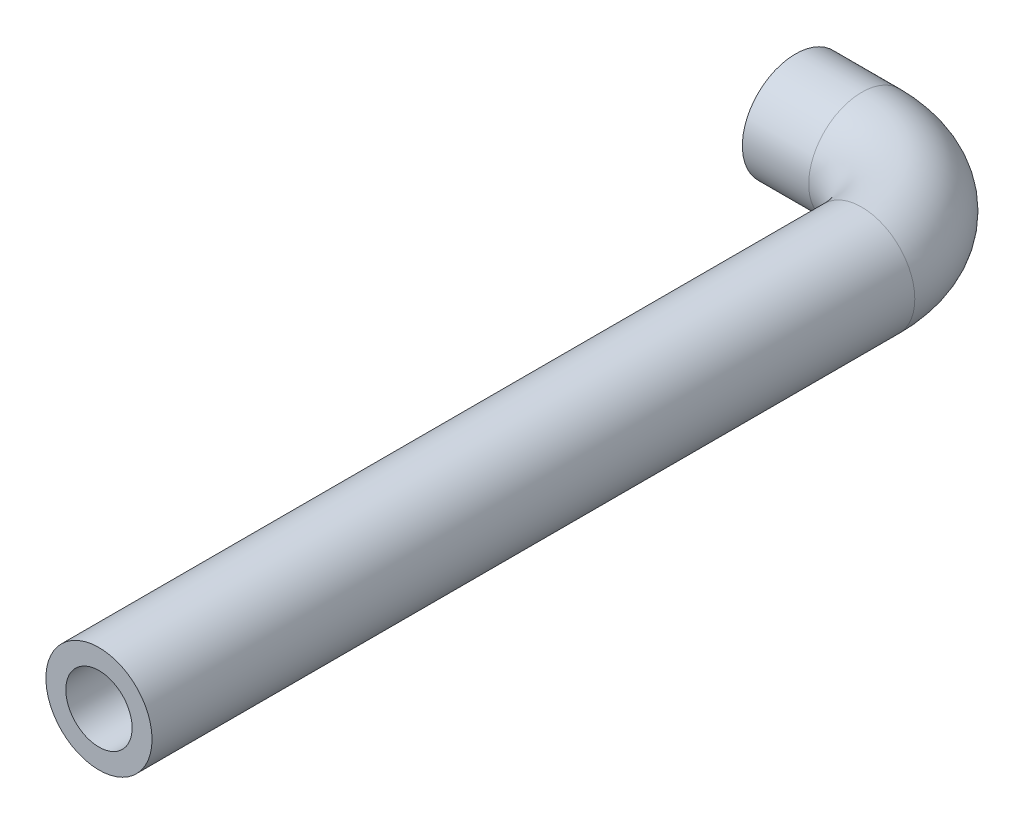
ISO-10303-21;
HEADER;
FILE_DESCRIPTION(('STEP AP214'),'2;1');
FILE_NAME('part.step','',(''),(''),'','','');
FILE_SCHEMA(('AUTOMOTIVE_DESIGN { 1 0 10303 214 1 1 1 1 }'));
ENDSEC;
DATA;
#1=APPLICATION_CONTEXT('core data for automotive mechanical design processes');
#2=APPLICATION_PROTOCOL_DEFINITION('international standard','automotive_design',2000,#1);
#3=PRODUCT_CONTEXT('',#1,'mechanical');
#4=PRODUCT('Part','Part','',(#3));
#5=PRODUCT_RELATED_PRODUCT_CATEGORY('part','',(#4));
#6=PRODUCT_DEFINITION_FORMATION('','',#4);
#7=PRODUCT_DEFINITION_CONTEXT('part definition',#1,'design');
#8=PRODUCT_DEFINITION('design','',#6,#7);
#9=PRODUCT_DEFINITION_SHAPE('','',#8);
#10=(LENGTH_UNIT() NAMED_UNIT(*) SI_UNIT(.MILLI.,.METRE.));
#11=(NAMED_UNIT(*) PLANE_ANGLE_UNIT() SI_UNIT($,.RADIAN.));
#12=(NAMED_UNIT(*) SI_UNIT($,.STERADIAN.) SOLID_ANGLE_UNIT());
#13=UNCERTAINTY_MEASURE_WITH_UNIT(LENGTH_MEASURE(1.E-05),#10,'distance_accuracy_value','');
#14=(GEOMETRIC_REPRESENTATION_CONTEXT(3) GLOBAL_UNCERTAINTY_ASSIGNED_CONTEXT((#13)) GLOBAL_UNIT_ASSIGNED_CONTEXT((#10,
#11,#12)) REPRESENTATION_CONTEXT('',''));
#15=CARTESIAN_POINT('',(0.,0.,0.));
#16=DIRECTION('',(0.,0.,1.));
#17=DIRECTION('',(1.,0.,0.));
#18=AXIS2_PLACEMENT_3D('',#15,#16,#17);
#19=CARTESIAN_POINT('',(0.,0.,0.));
#20=DIRECTION('',(1.,0.,0.));
#21=DIRECTION('',(0.,0.,-1.));
#22=AXIS2_PLACEMENT_3D('',#19,#20,#21);
#23=CYLINDRICAL_SURFACE('',#22,8.);
#24=CARTESIAN_POINT('',(10.,0.,0.));
#25=DIRECTION('',(1.,0.,0.));
#26=DIRECTION('',(0.,0.,-1.));
#27=AXIS2_PLACEMENT_3D('',#24,#25,#26);
#28=CIRCLE('',#27,8.);
#29=CARTESIAN_POINT('',(10.,0.,-8.));
#30=VERTEX_POINT('',#29);
#31=EDGE_CURVE('E79',#30,#30,#28,.T.);
#32=ORIENTED_EDGE('',*,*,#31,.F.);
#33=EDGE_LOOP('',(#32));
#34=FACE_BOUND('',#33,.T.);
#35=CARTESIAN_POINT('',(0.,0.,0.));
#36=DIRECTION('',(1.,0.,0.));
#37=DIRECTION('',(0.,0.,-1.));
#38=AXIS2_PLACEMENT_3D('',#35,#36,#37);
#39=CIRCLE('',#38,8.);
#40=CARTESIAN_POINT('',(0.,0.,-8.));
#41=VERTEX_POINT('',#40);
#42=EDGE_CURVE('E48',#41,#41,#39,.T.);
#43=ORIENTED_EDGE('',*,*,#42,.T.);
#44=EDGE_LOOP('',(#43));
#45=FACE_BOUND('',#44,.T.);
#46=ADVANCED_FACE('F33',(#34,#45),#23,.T.);
#47=CARTESIAN_POINT('',(10.,0.,15.));
#48=DIRECTION('',(0.,-1.,0.));
#49=DIRECTION('',(0.,0.,-1.));
#50=AXIS2_PLACEMENT_3D('',#47,#48,#49);
#51=TOROIDAL_SURFACE('',#50,15.,8.);
#52=CARTESIAN_POINT('',(25.,0.,15.));
#53=DIRECTION('',(0.,0.,1.));
#54=DIRECTION('',(1.,0.,0.));
#55=AXIS2_PLACEMENT_3D('',#52,#53,#54);
#56=CIRCLE('',#55,8.);
#57=CARTESIAN_POINT('',(33.,0.,15.));
#58=VERTEX_POINT('',#57);
#59=EDGE_CURVE('E37',#58,#58,#56,.T.);
#60=CARTESIAN_POINT('',(10.,0.,15.));
#61=DIRECTION('',(0.,-1.,0.));
#62=DIRECTION('',(0.,0.,-1.));
#63=AXIS2_PLACEMENT_3D('',#60,#61,#62);
#64=CIRCLE('',#63,23.);
#65=EDGE_CURVE('',#30,#58,#64,.T.);
#66=ORIENTED_EDGE('',*,*,#31,.T.);
#67=ORIENTED_EDGE('',*,*,#59,.F.);
#68=ORIENTED_EDGE('',*,*,#65,.T.);
#69=ORIENTED_EDGE('',*,*,#65,.F.);
#70=EDGE_LOOP('',(#66,#68,#67,#69));
#71=FACE_BOUND('',#70,.T.);
#72=ADVANCED_FACE('F87',(#71),#51,.T.);
#73=CARTESIAN_POINT('',(25.,0.,15.));
#74=DIRECTION('',(0.,0.,1.));
#75=DIRECTION('',(1.,0.,0.));
#76=AXIS2_PLACEMENT_3D('',#73,#74,#75);
#77=CYLINDRICAL_SURFACE('',#76,8.);
#78=CARTESIAN_POINT('',(25.,0.,130.));
#79=DIRECTION('',(0.,0.,1.));
#80=DIRECTION('',(1.,0.,0.));
#81=AXIS2_PLACEMENT_3D('',#78,#79,#80);
#82=CIRCLE('',#81,8.);
#83=CARTESIAN_POINT('',(33.,0.,130.));
#84=VERTEX_POINT('',#83);
#85=EDGE_CURVE('E53',#84,#84,#82,.T.);
#86=ORIENTED_EDGE('',*,*,#85,.F.);
#87=EDGE_LOOP('',(#86));
#88=FACE_BOUND('',#87,.T.);
#89=ORIENTED_EDGE('',*,*,#59,.T.);
#90=EDGE_LOOP('',(#89));
#91=FACE_BOUND('',#90,.T.);
#92=ADVANCED_FACE('F35',(#88,#91),#77,.T.);
#93=CARTESIAN_POINT('',(0.,0.,0.));
#94=DIRECTION('',(1.,0.,0.));
#95=DIRECTION('',(0.,0.,-1.));
#96=AXIS2_PLACEMENT_3D('',#93,#94,#95);
#97=PLANE('',#96);
#98=CARTESIAN_POINT('',(0.,0.,0.));
#99=DIRECTION('',(1.,0.,0.));
#100=DIRECTION('',(0.,0.,-1.));
#101=AXIS2_PLACEMENT_3D('',#98,#99,#100);
#102=CIRCLE('',#101,5.);
#103=CARTESIAN_POINT('',(0.,0.,-5.));
#104=VERTEX_POINT('',#103);
#105=EDGE_CURVE('E74',#104,#104,#102,.F.);
#106=ORIENTED_EDGE('',*,*,#105,.F.);
#107=EDGE_LOOP('',(#106));
#108=FACE_BOUND('',#107,.T.);
#109=ORIENTED_EDGE('',*,*,#42,.F.);
#110=EDGE_LOOP('',(#109));
#111=FACE_BOUND('',#110,.T.);
#112=ADVANCED_FACE('F93',(#108,#111),#97,.F.);
#113=CARTESIAN_POINT('',(25.,0.,130.));
#114=DIRECTION('',(0.,0.,1.));
#115=DIRECTION('',(1.,0.,0.));
#116=AXIS2_PLACEMENT_3D('',#113,#114,#115);
#117=PLANE('',#116);
#118=CARTESIAN_POINT('',(25.,0.,130.));
#119=DIRECTION('',(0.,0.,1.));
#120=DIRECTION('',(1.,0.,0.));
#121=AXIS2_PLACEMENT_3D('',#118,#119,#120);
#122=CIRCLE('',#121,5.);
#123=CARTESIAN_POINT('',(30.,0.,130.));
#124=VERTEX_POINT('',#123);
#125=EDGE_CURVE('E11',#124,#124,#122,.F.);
#126=ORIENTED_EDGE('',*,*,#125,.T.);
#127=EDGE_LOOP('',(#126));
#128=FACE_BOUND('',#127,.T.);
#129=ORIENTED_EDGE('',*,*,#85,.T.);
#130=EDGE_LOOP('',(#129));
#131=FACE_BOUND('',#130,.T.);
#132=ADVANCED_FACE('F60',(#128,#131),#117,.T.);
#133=CARTESIAN_POINT('',(0.,0.,0.));
#134=DIRECTION('',(1.,0.,0.));
#135=DIRECTION('',(0.,0.,-1.));
#136=AXIS2_PLACEMENT_3D('',#133,#134,#135);
#137=CYLINDRICAL_SURFACE('',#136,5.);
#138=CARTESIAN_POINT('',(10.,0.,0.));
#139=DIRECTION('',(1.,0.,0.));
#140=DIRECTION('',(0.,0.,-1.));
#141=AXIS2_PLACEMENT_3D('',#138,#139,#140);
#142=CIRCLE('',#141,5.);
#143=CARTESIAN_POINT('',(10.,0.,-5.));
#144=VERTEX_POINT('',#143);
#145=EDGE_CURVE('E71',#144,#144,#142,.F.);
#146=ORIENTED_EDGE('',*,*,#145,.F.);
#147=EDGE_LOOP('',(#146));
#148=FACE_BOUND('',#147,.T.);
#149=ORIENTED_EDGE('',*,*,#105,.T.);
#150=EDGE_LOOP('',(#149));
#151=FACE_BOUND('',#150,.T.);
#152=ADVANCED_FACE('F101',(#148,#151),#137,.F.);
#153=CARTESIAN_POINT('',(10.,0.,15.));
#154=DIRECTION('',(0.,-1.,0.));
#155=DIRECTION('',(0.,0.,-1.));
#156=AXIS2_PLACEMENT_3D('',#153,#154,#155);
#157=TOROIDAL_SURFACE('',#156,15.,5.);
#158=CARTESIAN_POINT('',(25.,0.,15.));
#159=DIRECTION('',(0.,0.,1.));
#160=DIRECTION('',(1.,0.,0.));
#161=AXIS2_PLACEMENT_3D('',#158,#159,#160);
#162=CIRCLE('',#161,5.);
#163=CARTESIAN_POINT('',(30.,0.,15.));
#164=VERTEX_POINT('',#163);
#165=EDGE_CURVE('E42',#164,#164,#162,.F.);
#166=CARTESIAN_POINT('',(10.,0.,15.));
#167=DIRECTION('',(0.,-1.,0.));
#168=DIRECTION('',(0.,0.,-1.));
#169=AXIS2_PLACEMENT_3D('',#166,#167,#168);
#170=CIRCLE('',#169,20.);
#171=EDGE_CURVE('',#144,#164,#170,.T.);
#172=ORIENTED_EDGE('',*,*,#145,.T.);
#173=ORIENTED_EDGE('',*,*,#165,.F.);
#174=ORIENTED_EDGE('',*,*,#171,.T.);
#175=ORIENTED_EDGE('',*,*,#171,.F.);
#176=EDGE_LOOP('',(#172,#174,#173,#175));
#177=FACE_BOUND('',#176,.T.);
#178=ADVANCED_FACE('F66',(#177),#157,.F.);
#179=CARTESIAN_POINT('',(25.,0.,15.));
#180=DIRECTION('',(0.,0.,1.));
#181=DIRECTION('',(1.,0.,0.));
#182=AXIS2_PLACEMENT_3D('',#179,#180,#181);
#183=CYLINDRICAL_SURFACE('',#182,5.);
#184=ORIENTED_EDGE('',*,*,#125,.F.);
#185=EDGE_LOOP('',(#184));
#186=FACE_BOUND('',#185,.T.);
#187=ORIENTED_EDGE('',*,*,#165,.T.);
#188=EDGE_LOOP('',(#187));
#189=FACE_BOUND('',#188,.T.);
#190=ADVANCED_FACE('F63',(#186,#189),#183,.F.);
#191=CLOSED_SHELL('',(#46,#72,#92,#112,#132,#152,#178,#190));
#192=MANIFOLD_SOLID_BREP('B2',#191);
#193=ADVANCED_BREP_SHAPE_REPRESENTATION('',(#18,#192),#14);
#194=SHAPE_DEFINITION_REPRESENTATION(#9,#193);
ENDSEC;
END-ISO-10303-21;
